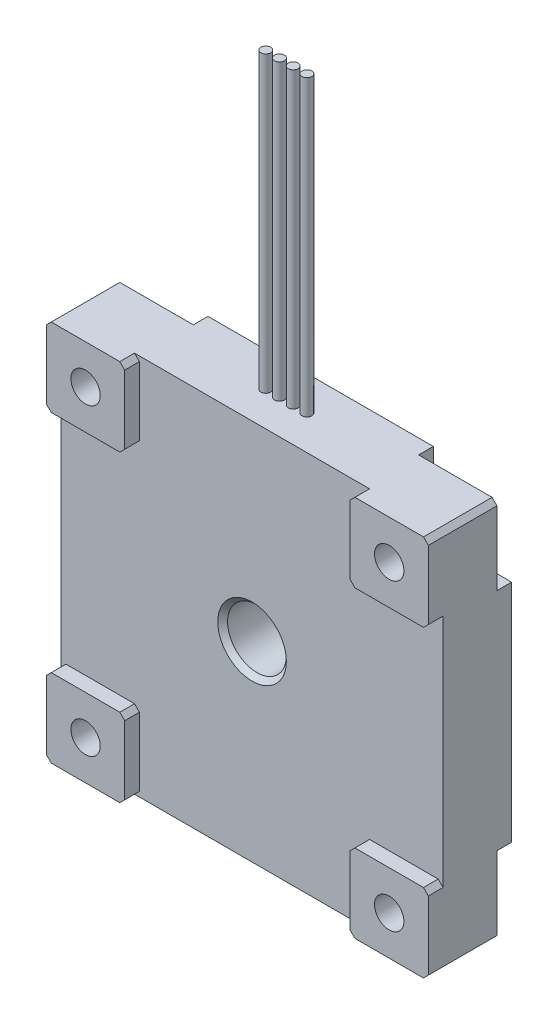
from build123d import *

# Parameters (mm, degrees)
SKETCH_1_W           = 39
SKETCH_1_H           = 39
EXTRUDE_1_DEPTH      = 8.5
SKETCH_2_OUTSIDE_W   = 52.162
SKETCH_2_OUTSIDE_H   = 52.162
SKETCH_2_OUTSIDE_W_2 = 39
SKETCH_2_OUTSIDE_H_2 = 39
SKETCH_2_OUTSIDE_R   = 1.5
CUT_EXTRUDE_1_DEPTH  = 29.857408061
CUT_EXTRUDE_16_DEPTH = 1.5
CUT_EXTRUDE_START    = -1.5
SKETCH_4_W           = 8
SKETCH_4_H           = 8
SKETCH_4_R           = 1.5
CUT_EXTRUDE_17_DEPTH = 1.5
CHAMFER_3_SIZE       = 0.5
SKETCH_5_R           = 2.5
CUT_EXTRUDE_20_DEPTH = 29.857408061
CHAMFER_4_SIZE       = 0.5
SKETCH_6_R           = 3
CUT_EXTRUDE_21_DEPTH = 29.857408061
CHAMFER_5_SIZE       = 0.5
SKETCH_7_R           = 0.5
EXTRUDE_2_DEPTH      = 30


with BuildPart() as part:
    # Sketch 1 → Extrude 1 (new body)
    with BuildSketch(Plane.XY):
        Rectangle(SKETCH_1_W, SKETCH_1_H)
    extrude(amount=EXTRUDE_1_DEPTH)

    # Sketch 2 outside → Cut-Extrude 1 (cut, through all)
    # profile 1 of 5: a face of its own
    with BuildSketch(Plane.XY.offset(8.5)):
        Rectangle(SKETCH_2_OUTSIDE_W, SKETCH_2_OUTSIDE_H)
        Rectangle(SKETCH_2_OUTSIDE_W_2, SKETCH_2_OUTSIDE_H_2, mode=Mode.SUBTRACT)
    # profile 2 of 5: a face of its own
    with BuildSketch(Plane.XY.offset(8.5)):
        with Locations((-15.5, 15.5)):
            Circle(SKETCH_2_OUTSIDE_R)
    # profile 3 of 5: a face of its own
    with BuildSketch(Plane.XY.offset(8.5)):
        with Locations(Location((15.5, 15.5, 0), (0, 0, 180))):
            Circle(SKETCH_2_OUTSIDE_R)
    # profile 4 of 5: a face of its own
    with BuildSketch(Plane.XY.offset(8.5)):
        with Locations((15.5, -15.5)):
            Circle(SKETCH_2_OUTSIDE_R)
    # profile 5 of 5: a face of its own
    with BuildSketch(Plane.XY.offset(8.5)):
        with Locations(Location((-15.5, -15.5, 0), (0, 0, 180))):
            Circle(SKETCH_2_OUTSIDE_R)
    extrude(amount=-CUT_EXTRUDE_1_DEPTH, mode=Mode.SUBTRACT)

    # Sketch 3 → Cut-Extrude 16 (cut)
    with BuildSketch(Plane.XY.offset(8.5)):
        Polygon((-11.5, 19.5), (-11.5, 11.5), (-19.5, 11.5), (-19.5, -11.5), (-11.5, -11.5), (-11.5, -19.5), (11.5, -19.5), (11.5, -11.5), (19.5, -11.5), (19.5, 11.5), (11.5, 11.5), (11.5, 19.5), align=None)
    extrude(amount=-CUT_EXTRUDE_16_DEPTH, mode=Mode.SUBTRACT)

    # Sketch 4 → Cut-Extrude 17 (cut)
    # profile 1 of 4: a face of its own
    with BuildSketch(Plane(origin=(0, 0, 0), x_dir=(-1, 0, 0), z_dir=(0, 0, -1)).offset(CUT_EXTRUDE_START)):
        with Locations((15.5, -15.5)):
            Rectangle(SKETCH_4_W, SKETCH_4_H)
        with Locations((15.5, -15.5)):
            Circle(SKETCH_4_R, mode=Mode.SUBTRACT)
    # profile 2 of 4: a face of its own
    with BuildSketch(Plane(origin=(0, 0, 0), x_dir=(-1, 0, 0), z_dir=(0, 0, -1)).offset(CUT_EXTRUDE_START)):
        with Locations((-15.5, -15.5)):
            Rectangle(SKETCH_4_W, SKETCH_4_H)
        with Locations(Location((-15.5, -15.5, 0), (0, 0, 180))):
            Circle(SKETCH_4_R, mode=Mode.SUBTRACT)
    # profile 3 of 4: a face of its own
    with BuildSketch(Plane(origin=(0, 0, 0), x_dir=(-1, 0, 0), z_dir=(0, 0, -1)).offset(CUT_EXTRUDE_START)):
        with Locations((15.5, 15.5)):
            Rectangle(SKETCH_4_W, SKETCH_4_H)
        with Locations(Location((15.5, 15.5, 0), (0, 0, 180))):
            Circle(SKETCH_4_R, mode=Mode.SUBTRACT)
    # profile 4 of 4: a face of its own
    with BuildSketch(Plane(origin=(0, 0, 0), x_dir=(-1, 0, 0), z_dir=(0, 0, -1)).offset(CUT_EXTRUDE_START)):
        with Locations((-15.5, 15.5)):
            Rectangle(SKETCH_4_W, SKETCH_4_H)
        with Locations((-15.5, 15.5)):
            Circle(SKETCH_4_R, mode=Mode.SUBTRACT)
    extrude(amount=CUT_EXTRUDE_17_DEPTH, mode=Mode.SUBTRACT)

    # Chamfer 3
    chamfer_3_edges = [part.edges().sort_by_distance(p)[0] for p in [
        (-19.5, 19.5, 5),
        (19.5, 19.5, 5),
        (19.5, -19.5, 5),
        (-19.5, -19.5, 5),
    ]]
    chamfer(chamfer_3_edges, length=CHAMFER_3_SIZE)

    # Sketch 5 → Cut-Extrude 20 (cut, through all)
    with BuildSketch(Plane.XY):
        Circle(SKETCH_5_R)
    extrude(amount=CUT_EXTRUDE_20_DEPTH, mode=Mode.SUBTRACT)

    # Chamfer 4
    chamfer_4_edges = [part.edges().sort_by_distance(p)[0] for p in [
        (-11.5, -11.5, 7.75),
        (-19.5, -11.5, 7.75),
        (-19.5, 11.5, 7.75),
        (-11.5, 11.5, 7.75),
        (-11.5, 19.5, 7.75),
        (11.5, 19.5, 7.75),
        (11.5, 11.5, 7.75),
        (19.5, 11.5, 7.75),
        (19.5, -11.5, 7.75),
        (11.5, -11.5, 7.75),
        (11.5, -19.5, 7.75),
        (-11.5, -19.5, 7.75),
    ]]
    chamfer(chamfer_4_edges, length=CHAMFER_4_SIZE)

    # Sketch 6 → Cut-Extrude 21 (cut, through all)
    with BuildSketch(Plane(origin=(0, 0, 0), x_dir=(-1, 0, 0), z_dir=(0, 0, -1))):
        Circle(SKETCH_6_R)
    extrude(amount=-CUT_EXTRUDE_21_DEPTH, mode=Mode.SUBTRACT)

    # Chamfer 5
    chamfer_5_edges = [part.edges().sort_by_distance(p)[0] for p in [
        (3, 0, 7),
        (3, 0, 0),
    ]]
    chamfer(chamfer_5_edges, length=CHAMFER_5_SIZE)

    # Sketch 7 → Extrude 2 (add)
    with BuildSketch(Plane(origin=(0, 19.5, 0), x_dir=(1, 0, 0), z_dir=(0, 1, 0))):
        with Locations((-2.1, -3.5)):
            Circle(SKETCH_7_R)
        with Locations((-0.7, -3.5)):
            Circle(SKETCH_7_R)
        with Locations((0.7, -3.5)):
            Circle(SKETCH_7_R)
        with Locations((2.1, -3.5)):
            Circle(SKETCH_7_R)
    extrude(amount=EXTRUDE_2_DEPTH)


solid = part.part
